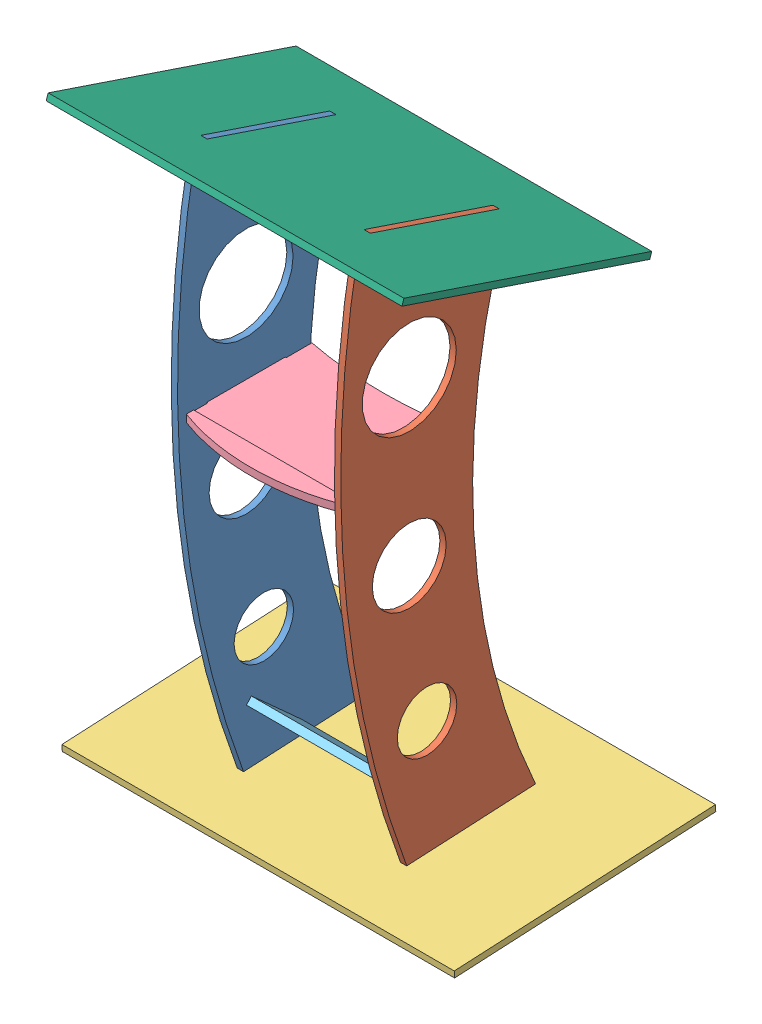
SolidWorks assembly Assem4.SLDASM, configuration Default (file format 9000). Lengths in mm.
Overall size (750 1138.96 565.07).
6 component instances, 6 part files, 15 mates.
Components (placement in the parent):
- side1-1: side1.SLDPRT [Default] at (354.0925 1125.3255 1010.7013) size (12 1093.51 372.46)
- side2-1: side2.SLDPRT [Default] at (666.0925 1125.3255 1010.7013) size (12 1093.51 372.46)
- base-1: base.SLDPRT [Default] at (891.0925 30.541 1045.1186) x (-1 0 0) z (0 -0.998671 -0.051541) size (750 500 12)
- mid1-3: mid1.SLDPRT [Default] at (550.4089 671.5938 815.9705) x (0 0 -1) z (1 0 0) size (266.77 14 314)
- mid2-1: mid2.SLDPRT [Default] at (361.0925 59.2761 822.8638) x (1 0 0) z (0 0.669722 0.742612) size (314 14 130)
- top-1: top.SLDPRT [Default] at (176.0925 1146.145 1110.237) x (1 0 0) z (0 0.318763 0.947834) size (680 12 500)
Mates (geometry in assembly coordinates):
- Coincident2: coincident aligned: line of side1-1 through (366.0925 49.5658 676.7997) axis (-1 0 0); line of side2-1 through (678.0925 49.5658 676.7997) axis (-1 0 0)
- Coincident3: coincident anti-aligned: plane of side2-1 through (678.0925 603.7658 -540.1429) normal (1 0 0); plane of base-1 through (678.0925 51.0931 685.7002) normal (-1 0 0)
- Coincident4: coincident aligned: plane of side2-1 through (691.0925 37.8136 671.3789) normal (0 -0.998671 -0.051541); plane of base-1 through (891.0925 18.557 1044.5001) normal (0 -0.998671 -0.051541)
- Coincident5: coincident anti-aligned: plane of side2-1 through (691.0925 1139.2005 741.8569) normal (0 0.051541 -0.998671); plane of base-1 through (678.0925 51.0931 685.7002) normal (0 -0.051541 0.998671)
- Coincident6: coincident aligned: plane of side1-1 through (379.0925 37.8136 671.3789) normal (0 -0.998671 -0.051541); plane of base-1 through (891.0925 18.557 1044.5001) normal (0 -0.998671 -0.051541)
- Coincident7: coincident anti-aligned: plane of side1-1 through (354.0925 603.7658 -540.1429) normal (-1 0 0); plane of base-1 through (354.0925 51.0931 685.7002) normal (1 0 0)
- Coincident11: coincident anti-aligned: plane of side1-1 through (361.0925 1125.3255 1010.7013) normal (1 0 0); plane of mid1-3 through (361.0925 683.5938 993.1867) normal (-1 0 0)
- Coincident12: coincident anti-aligned: plane of side1-1 through (361.0925 683.5938 843.1867) normal (0 -1 0); plane of mid1-3 through (550.4089 683.5938 815.9705) normal (0 1 0)
- Coincident13: coincident anti-aligned: plane of side1-1 through (361.0925 683.5938 993.1867) normal (0 0 -1); plane of mid1-3 through (368.0925 683.5938 993.1867) normal (0 0 1)
- Coincident14: coincident anti-aligned: plane of side1-1 through (361.0925 136.2941 908.2642) normal (0 0.742612 -0.669722); plane of mid2-1 through (361.0925 59.2761 822.8638) normal (0 -0.742612 0.669722)
- Coincident15: coincident anti-aligned: plane of side1-1 through (361.0925 1125.3255 1010.7013) normal (1 0 0); plane of mid2-1 through (361.0925 69.6726 813.4877) normal (-1 0 0)
- Coincident16: coincident anti-aligned: plane of side1-1 through (361.0925 78.2332 825.9663) normal (0 0.669722 0.742612); plane of mid2-1 through (361.0925 79.7185 824.6269) normal (0 -0.669722 -0.742612)
- Coincident17: coincident anti-aligned: plane of side2-1 through (664.0925 1024.9087 749.744) normal (0 0.947834 -0.318763); plane of top-1 through (176.0925 1146.145 1110.237) normal (0 -0.947834 0.318763)
- Coincident18: coincident anti-aligned: plane of side2-1 through (666.0925 603.7658 -540.1429) normal (-1 0 0); plane of top-1 through (666.0925 1023.1193 750.6975) normal (1 0 0)
- Coincident22: coincident: plane of side2-1 through (678.0925 603.7658 -540.1429) normal (1 0 0); line of top-1 through (678.0925 1025.015 750.06) axis (0 0.318763 0.947834)
